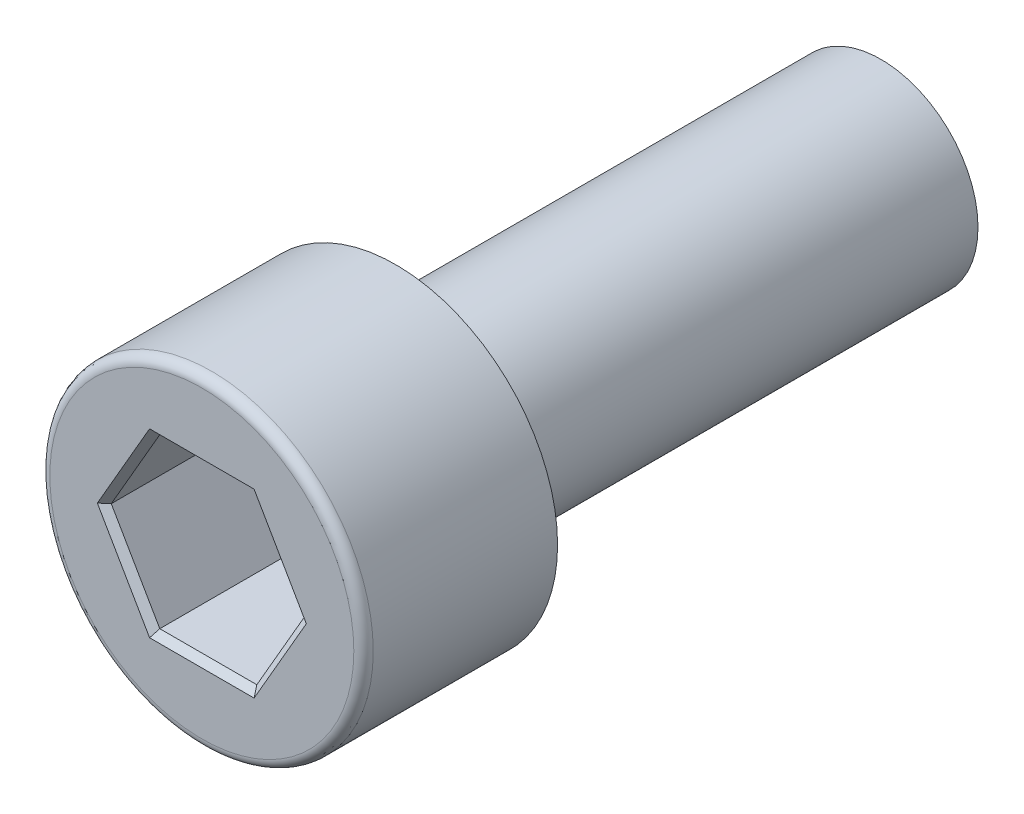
from build123d import *

# Parameters (mm, degrees)
ESQUISSE1_R             = 3
BASE_EXTRUSION_DEPTH    = 15
ESQUISSE2_R             = 5
BOSS_EXTRU_1_DEPTH      = 6
ENL_V_MAT_EXTRU_1_DEPTH = 4
CHANFREIN3_SIZE         = 0.2
CONG_1_R                = 0.3


with BuildPart() as part:
    # Esquisse1 → Base-Extrusion (new body)
    with BuildSketch(Plane.XY):
        Circle(ESQUISSE1_R)
    extrude(amount=BASE_EXTRUSION_DEPTH)

    # Esquisse2 → Boss.-Extru.1 (add)
    with BuildSketch(Plane.XY.offset(15)):
        Circle(ESQUISSE2_R)
    extrude(amount=BOSS_EXTRU_1_DEPTH)

    # Esquisse3 → Enl_v. mat.-Extru.1 (cut)
    with BuildSketch(Plane.XY.offset(21)):
        Polygon((-3, 0), (-1.500108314, 2.598013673), (1.500108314, 2.598013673), (3, 0), (1.500108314, -2.598013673), (-1.500108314, -2.598013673), align=None)
    extrude(amount=-ENL_V_MAT_EXTRU_1_DEPTH, mode=Mode.SUBTRACT)

    # Chanfrein3
    chanfrein3_edges = [part.edges().sort_by_distance(p)[0] for p in [
        (-2.250054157, -1.299006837, 21),
        (0, -2.598013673, 21),
        (2.250054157, -1.299006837, 21),
        (2.250054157, 1.299006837, 21),
        (0, 2.598013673, 21),
        (-2.250054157, 1.299006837, 21),
    ]]
    chamfer(chanfrein3_edges, length=CHANFREIN3_SIZE)

    # Cong_1
    cong_1_edges = [part.edges().sort_by_distance(p)[0] for p in [
        (-5, 0, 21),
    ]]
    fillet(cong_1_edges, radius=CONG_1_R)


solid = part.part
